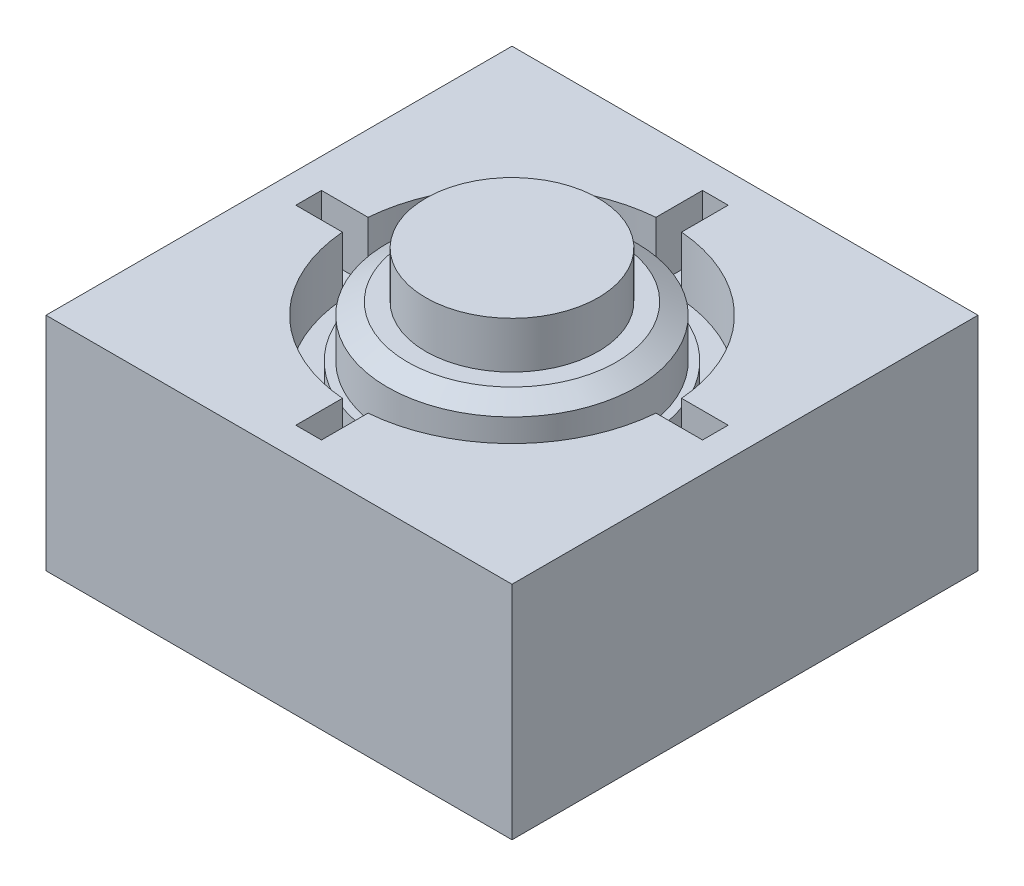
ISO-10303-21;
HEADER;
FILE_DESCRIPTION(('STEP AP214'),'2;1');
FILE_NAME('part.step','',(''),(''),'','','');
FILE_SCHEMA(('AUTOMOTIVE_DESIGN { 1 0 10303 214 1 1 1 1 }'));
ENDSEC;
DATA;
#1=APPLICATION_CONTEXT('core data for automotive mechanical design processes');
#2=APPLICATION_PROTOCOL_DEFINITION('international standard','automotive_design',2000,#1);
#3=PRODUCT_CONTEXT('',#1,'mechanical');
#4=PRODUCT('Part','Part','',(#3));
#5=PRODUCT_RELATED_PRODUCT_CATEGORY('part','',(#4));
#6=PRODUCT_DEFINITION_FORMATION('','',#4);
#7=PRODUCT_DEFINITION_CONTEXT('part definition',#1,'design');
#8=PRODUCT_DEFINITION('design','',#6,#7);
#9=PRODUCT_DEFINITION_SHAPE('','',#8);
#10=(LENGTH_UNIT() NAMED_UNIT(*) SI_UNIT(.MILLI.,.METRE.));
#11=(NAMED_UNIT(*) PLANE_ANGLE_UNIT() SI_UNIT($,.RADIAN.));
#12=(NAMED_UNIT(*) SI_UNIT($,.STERADIAN.) SOLID_ANGLE_UNIT());
#13=UNCERTAINTY_MEASURE_WITH_UNIT(LENGTH_MEASURE(1.E-05),#10,'distance_accuracy_value','');
#14=(GEOMETRIC_REPRESENTATION_CONTEXT(3) GLOBAL_UNCERTAINTY_ASSIGNED_CONTEXT((#13)) GLOBAL_UNIT_ASSIGNED_CONTEXT((#10,
#11,#12)) REPRESENTATION_CONTEXT('',''));
#15=CARTESIAN_POINT('',(0.,0.,0.));
#16=DIRECTION('',(0.,0.,1.));
#17=DIRECTION('',(1.,0.,0.));
#18=AXIS2_PLACEMENT_3D('',#15,#16,#17);
#19=CARTESIAN_POINT('',(0.,7.,0.));
#20=DIRECTION('',(0.,1.,0.));
#21=DIRECTION('',(0.,0.,1.));
#22=AXIS2_PLACEMENT_3D('',#19,#20,#21);
#23=CYLINDRICAL_SURFACE('',#22,6.75);
#24=CARTESIAN_POINT('',(0.,9.5,0.));
#25=DIRECTION('',(0.,1.,0.));
#26=DIRECTION('',(0.,0.,1.));
#27=AXIS2_PLACEMENT_3D('',#24,#25,#26);
#28=CIRCLE('',#27,6.75);
#29=CARTESIAN_POINT('',(6.72755527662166,9.5,0.550000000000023));
#30=VERTEX_POINT('',#29);
#31=CARTESIAN_POINT('',(0.550000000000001,9.5,6.72755527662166));
#32=VERTEX_POINT('',#31);
#33=EDGE_CURVE('E178',#30,#32,#28,.F.);
#34=ORIENTED_EDGE('',*,*,#33,.F.);
#35=DIRECTION('',(0.,1.,0.));
#36=VECTOR('',#35,1.);
#37=CARTESIAN_POINT('',(6.72755527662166,7.,0.550000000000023));
#38=LINE('',#37,#36);
#39=CARTESIAN_POINT('',(6.72755527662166,7.,0.550000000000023));
#40=VERTEX_POINT('',#39);
#41=EDGE_CURVE('E188',#40,#30,#38,.T.);
#42=ORIENTED_EDGE('',*,*,#41,.F.);
#43=CARTESIAN_POINT('',(0.,7.,0.));
#44=DIRECTION('',(0.,1.,0.));
#45=DIRECTION('',(0.,0.,1.));
#46=AXIS2_PLACEMENT_3D('',#43,#44,#45);
#47=CIRCLE('',#46,6.75);
#48=CARTESIAN_POINT('',(0.550000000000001,7.,6.72755527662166));
#49=VERTEX_POINT('',#48);
#50=EDGE_CURVE('E275',#49,#40,#47,.T.);
#51=ORIENTED_EDGE('',*,*,#50,.F.);
#52=DIRECTION('',(0.,1.,0.));
#53=VECTOR('',#52,1.);
#54=CARTESIAN_POINT('',(0.550000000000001,7.,6.72755527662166));
#55=LINE('',#54,#53);
#56=EDGE_CURVE('E191',#49,#32,#55,.T.);
#57=ORIENTED_EDGE('',*,*,#56,.T.);
#58=EDGE_LOOP('',(#34,#42,#51,#57));
#59=FACE_BOUND('',#58,.T.);
#60=ADVANCED_FACE('F39',(#59),#23,.F.);
#61=CARTESIAN_POINT('',(0.,9.5,0.));
#62=DIRECTION('',(0.,1.,0.));
#63=DIRECTION('',(0.,0.,1.));
#64=AXIS2_PLACEMENT_3D('',#61,#62,#63);
#65=CIRCLE('',#64,6.75);
#66=CARTESIAN_POINT('',(-6.72755527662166,9.5,-0.550000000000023));
#67=VERTEX_POINT('',#66);
#68=CARTESIAN_POINT('',(-0.550000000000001,9.5,-6.72755527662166));
#69=VERTEX_POINT('',#68);
#70=EDGE_CURVE('E386',#67,#69,#65,.F.);
#71=ORIENTED_EDGE('',*,*,#70,.F.);
#72=DIRECTION('',(0.,1.,0.));
#73=VECTOR('',#72,1.);
#74=CARTESIAN_POINT('',(-6.72755527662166,7.,-0.550000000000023));
#75=LINE('',#74,#73);
#76=CARTESIAN_POINT('',(-6.72755527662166,7.,-0.550000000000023));
#77=VERTEX_POINT('',#76);
#78=EDGE_CURVE('E218',#77,#67,#75,.T.);
#79=ORIENTED_EDGE('',*,*,#78,.F.);
#80=CARTESIAN_POINT('',(-0.549999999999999,7.,-6.72755527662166));
#81=VERTEX_POINT('',#80);
#82=EDGE_CURVE('E279',#81,#77,#47,.T.);
#83=ORIENTED_EDGE('',*,*,#82,.F.);
#84=DIRECTION('',(0.,1.,0.));
#85=VECTOR('',#84,1.);
#86=CARTESIAN_POINT('',(-0.550000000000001,7.,-6.72755527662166));
#87=LINE('',#86,#85);
#88=EDGE_CURVE('E239',#81,#69,#87,.T.);
#89=ORIENTED_EDGE('',*,*,#88,.T.);
#90=EDGE_LOOP('',(#71,#79,#83,#89));
#91=FACE_BOUND('',#90,.T.);
#92=ADVANCED_FACE('F324',(#91),#23,.F.);
#93=CARTESIAN_POINT('',(0.,9.5,0.));
#94=DIRECTION('',(0.,1.,0.));
#95=DIRECTION('',(0.,0.,1.));
#96=AXIS2_PLACEMENT_3D('',#93,#94,#95);
#97=CIRCLE('',#96,6.75);
#98=CARTESIAN_POINT('',(0.549999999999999,9.5,-6.72755527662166));
#99=VERTEX_POINT('',#98);
#100=CARTESIAN_POINT('',(6.72755527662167,9.5,-0.549999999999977));
#101=VERTEX_POINT('',#100);
#102=EDGE_CURVE('E193',#99,#101,#97,.F.);
#103=ORIENTED_EDGE('',*,*,#102,.F.);
#104=DIRECTION('',(0.,1.,0.));
#105=VECTOR('',#104,1.);
#106=CARTESIAN_POINT('',(0.549999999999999,7.,-6.72755527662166));
#107=LINE('',#106,#105);
#108=CARTESIAN_POINT('',(0.549999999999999,7.,-6.72755527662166));
#109=VERTEX_POINT('',#108);
#110=EDGE_CURVE('E247',#109,#99,#107,.T.);
#111=ORIENTED_EDGE('',*,*,#110,.F.);
#112=CARTESIAN_POINT('',(6.72755527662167,7.,-0.549999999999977));
#113=VERTEX_POINT('',#112);
#114=EDGE_CURVE('E278',#113,#109,#47,.T.);
#115=ORIENTED_EDGE('',*,*,#114,.F.);
#116=DIRECTION('',(0.,1.,0.));
#117=VECTOR('',#116,1.);
#118=CARTESIAN_POINT('',(6.72755527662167,7.,-0.549999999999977));
#119=LINE('',#118,#117);
#120=EDGE_CURVE('E199',#113,#101,#119,.T.);
#121=ORIENTED_EDGE('',*,*,#120,.T.);
#122=EDGE_LOOP('',(#103,#111,#115,#121));
#123=FACE_BOUND('',#122,.T.);
#124=ADVANCED_FACE('F330',(#123),#23,.F.);
#125=CARTESIAN_POINT('',(0.,9.5,0.));
#126=DIRECTION('',(0.,1.,0.));
#127=DIRECTION('',(0.,0.,1.));
#128=AXIS2_PLACEMENT_3D('',#125,#126,#127);
#129=CIRCLE('',#128,6.75);
#130=CARTESIAN_POINT('',(-0.549999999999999,9.5,6.72755527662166));
#131=VERTEX_POINT('',#130);
#132=CARTESIAN_POINT('',(-6.72755527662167,9.5,0.549999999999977));
#133=VERTEX_POINT('',#132);
#134=EDGE_CURVE('E347',#131,#133,#129,.F.);
#135=ORIENTED_EDGE('',*,*,#134,.F.);
#136=DIRECTION('',(0.,1.,0.));
#137=VECTOR('',#136,1.);
#138=CARTESIAN_POINT('',(-0.549999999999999,7.,6.72755527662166));
#139=LINE('',#138,#137);
#140=CARTESIAN_POINT('',(-0.549999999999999,7.,6.72755527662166));
#141=VERTEX_POINT('',#140);
#142=EDGE_CURVE('E260',#141,#131,#139,.T.);
#143=ORIENTED_EDGE('',*,*,#142,.F.);
#144=CARTESIAN_POINT('',(-6.72755527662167,7.,0.549999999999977));
#145=VERTEX_POINT('',#144);
#146=EDGE_CURVE('E272',#145,#141,#47,.T.);
#147=ORIENTED_EDGE('',*,*,#146,.F.);
#148=DIRECTION('',(0.,1.,0.));
#149=VECTOR('',#148,1.);
#150=CARTESIAN_POINT('',(-6.72755527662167,7.,0.549999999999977));
#151=LINE('',#150,#149);
#152=EDGE_CURVE('E222',#145,#133,#151,.T.);
#153=ORIENTED_EDGE('',*,*,#152,.T.);
#154=EDGE_LOOP('',(#135,#143,#147,#153));
#155=FACE_BOUND('',#154,.T.);
#156=ADVANCED_FACE('F326',(#155),#23,.F.);
#157=CARTESIAN_POINT('',(-0.549999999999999,7.,6.72755527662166));
#158=DIRECTION('',(-1.,0.,0.));
#159=DIRECTION('',(0.,0.,1.));
#160=AXIS2_PLACEMENT_3D('',#157,#158,#159);
#161=PLANE('',#160);
#162=DIRECTION('',(0.,0.,-1.));
#163=VECTOR('',#162,1.);
#164=CARTESIAN_POINT('',(-0.549999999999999,9.5,6.72755527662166));
#165=LINE('',#164,#163);
#166=CARTESIAN_POINT('',(-0.549999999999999,9.5,8.72755527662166));
#167=VERTEX_POINT('',#166);
#168=EDGE_CURVE('E352',#167,#131,#165,.T.);
#169=ORIENTED_EDGE('',*,*,#168,.F.);
#170=DIRECTION('',(0.,1.,0.));
#171=VECTOR('',#170,1.);
#172=CARTESIAN_POINT('',(-0.549999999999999,7.,8.72755527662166));
#173=LINE('',#172,#171);
#174=CARTESIAN_POINT('',(-0.549999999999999,7.,8.72755527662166));
#175=VERTEX_POINT('',#174);
#176=EDGE_CURVE('E252',#175,#167,#173,.T.);
#177=ORIENTED_EDGE('',*,*,#176,.F.);
#178=DIRECTION('',(0.,0.,1.));
#179=VECTOR('',#178,1.);
#180=CARTESIAN_POINT('',(-0.549999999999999,7.,6.72755527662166));
#181=LINE('',#180,#179);
#182=EDGE_CURVE('E233',#141,#175,#181,.T.);
#183=ORIENTED_EDGE('',*,*,#182,.F.);
#184=ORIENTED_EDGE('',*,*,#142,.T.);
#185=EDGE_LOOP('',(#169,#177,#183,#184));
#186=FACE_BOUND('',#185,.T.);
#187=ADVANCED_FACE('F335',(#186),#161,.F.);
#188=CARTESIAN_POINT('',(0.550000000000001,7.,6.72755527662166));
#189=DIRECTION('',(1.,0.,0.));
#190=DIRECTION('',(0.,0.,-1.));
#191=AXIS2_PLACEMENT_3D('',#188,#189,#190);
#192=PLANE('',#191);
#193=DIRECTION('',(0.,0.,1.));
#194=VECTOR('',#193,1.);
#195=CARTESIAN_POINT('',(0.550000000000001,9.5,6.72755527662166));
#196=LINE('',#195,#194);
#197=CARTESIAN_POINT('',(0.550000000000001,9.5,8.72755527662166));
#198=VERTEX_POINT('',#197);
#199=EDGE_CURVE('E384',#32,#198,#196,.T.);
#200=ORIENTED_EDGE('',*,*,#199,.F.);
#201=ORIENTED_EDGE('',*,*,#56,.F.);
#202=DIRECTION('',(0.,0.,-1.));
#203=VECTOR('',#202,1.);
#204=CARTESIAN_POINT('',(0.550000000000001,7.,6.72755527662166));
#205=LINE('',#204,#203);
#206=CARTESIAN_POINT('',(0.550000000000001,7.,8.72755527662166));
#207=VERTEX_POINT('',#206);
#208=EDGE_CURVE('E255',#207,#49,#205,.T.);
#209=ORIENTED_EDGE('',*,*,#208,.F.);
#210=DIRECTION('',(0.,1.,0.));
#211=VECTOR('',#210,1.);
#212=CARTESIAN_POINT('',(0.550000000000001,7.,8.72755527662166));
#213=LINE('',#212,#211);
#214=EDGE_CURVE('E256',#207,#198,#213,.T.);
#215=ORIENTED_EDGE('',*,*,#214,.T.);
#216=EDGE_LOOP('',(#200,#201,#209,#215));
#217=FACE_BOUND('',#216,.T.);
#218=ADVANCED_FACE('F341',(#217),#192,.F.);
#219=CARTESIAN_POINT('',(-0.549999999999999,7.,8.72755527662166));
#220=DIRECTION('',(0.,0.,1.));
#221=DIRECTION('',(1.,0.,0.));
#222=AXIS2_PLACEMENT_3D('',#219,#220,#221);
#223=PLANE('',#222);
#224=DIRECTION('',(-1.,0.,0.));
#225=VECTOR('',#224,1.);
#226=CARTESIAN_POINT('',(-0.549999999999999,9.5,8.72755527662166));
#227=LINE('',#226,#225);
#228=EDGE_CURVE('E390',#198,#167,#227,.T.);
#229=ORIENTED_EDGE('',*,*,#228,.F.);
#230=ORIENTED_EDGE('',*,*,#214,.F.);
#231=DIRECTION('',(1.,0.,0.));
#232=VECTOR('',#231,1.);
#233=CARTESIAN_POINT('',(-0.549999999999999,7.,8.72755527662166));
#234=LINE('',#233,#232);
#235=EDGE_CURVE('E264',#175,#207,#234,.T.);
#236=ORIENTED_EDGE('',*,*,#235,.F.);
#237=ORIENTED_EDGE('',*,*,#176,.T.);
#238=EDGE_LOOP('',(#229,#230,#236,#237));
#239=FACE_BOUND('',#238,.T.);
#240=ADVANCED_FACE('F417',(#239),#223,.F.);
#241=CARTESIAN_POINT('',(-0.550000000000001,7.,-8.72755527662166));
#242=DIRECTION('',(-1.,0.,0.));
#243=DIRECTION('',(0.,0.,1.));
#244=AXIS2_PLACEMENT_3D('',#241,#242,#243);
#245=PLANE('',#244);
#246=DIRECTION('',(0.,0.,-1.));
#247=VECTOR('',#246,1.);
#248=CARTESIAN_POINT('',(-0.550000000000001,9.5,-8.72755527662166));
#249=LINE('',#248,#247);
#250=CARTESIAN_POINT('',(-0.550000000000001,9.5,-8.72755527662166));
#251=VERTEX_POINT('',#250);
#252=EDGE_CURVE('E382',#69,#251,#249,.T.);
#253=ORIENTED_EDGE('',*,*,#252,.F.);
#254=ORIENTED_EDGE('',*,*,#88,.F.);
#255=DIRECTION('',(0.,0.,1.));
#256=VECTOR('',#255,1.);
#257=CARTESIAN_POINT('',(-0.550000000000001,7.,-8.72755527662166));
#258=LINE('',#257,#256);
#259=CARTESIAN_POINT('',(-0.550000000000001,7.,-8.72755527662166));
#260=VERTEX_POINT('',#259);
#261=EDGE_CURVE('E230',#260,#81,#258,.T.);
#262=ORIENTED_EDGE('',*,*,#261,.F.);
#263=DIRECTION('',(0.,1.,0.));
#264=VECTOR('',#263,1.);
#265=CARTESIAN_POINT('',(-0.550000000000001,7.,-8.72755527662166));
#266=LINE('',#265,#264);
#267=EDGE_CURVE('E240',#260,#251,#266,.T.);
#268=ORIENTED_EDGE('',*,*,#267,.T.);
#269=EDGE_LOOP('',(#253,#254,#262,#268));
#270=FACE_BOUND('',#269,.T.);
#271=ADVANCED_FACE('F419',(#270),#245,.F.);
#272=CARTESIAN_POINT('',(-0.550000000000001,7.,-8.72755527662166));
#273=DIRECTION('',(0.,0.,-1.));
#274=DIRECTION('',(-1.,0.,0.));
#275=AXIS2_PLACEMENT_3D('',#272,#273,#274);
#276=PLANE('',#275);
#277=DIRECTION('',(1.,0.,0.));
#278=VECTOR('',#277,1.);
#279=CARTESIAN_POINT('',(-0.550000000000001,9.5,-8.72755527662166));
#280=LINE('',#279,#278);
#281=CARTESIAN_POINT('',(0.549999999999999,9.5,-8.72755527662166));
#282=VERTEX_POINT('',#281);
#283=EDGE_CURVE('E380',#251,#282,#280,.T.);
#284=ORIENTED_EDGE('',*,*,#283,.F.);
#285=ORIENTED_EDGE('',*,*,#267,.F.);
#286=DIRECTION('',(-1.,0.,0.));
#287=VECTOR('',#286,1.);
#288=CARTESIAN_POINT('',(-0.550000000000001,7.,-8.72755527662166));
#289=LINE('',#288,#287);
#290=CARTESIAN_POINT('',(0.549999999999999,7.,-8.72755527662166));
#291=VERTEX_POINT('',#290);
#292=EDGE_CURVE('E236',#291,#260,#289,.T.);
#293=ORIENTED_EDGE('',*,*,#292,.F.);
#294=DIRECTION('',(0.,1.,0.));
#295=VECTOR('',#294,1.);
#296=CARTESIAN_POINT('',(0.549999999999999,7.,-8.72755527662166));
#297=LINE('',#296,#295);
#298=EDGE_CURVE('E244',#291,#282,#297,.T.);
#299=ORIENTED_EDGE('',*,*,#298,.T.);
#300=EDGE_LOOP('',(#284,#285,#293,#299));
#301=FACE_BOUND('',#300,.T.);
#302=ADVANCED_FACE('F425',(#301),#276,.F.);
#303=CARTESIAN_POINT('',(0.549999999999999,7.,-8.72755527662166));
#304=DIRECTION('',(1.,0.,0.));
#305=DIRECTION('',(0.,0.,-1.));
#306=AXIS2_PLACEMENT_3D('',#303,#304,#305);
#307=PLANE('',#306);
#308=DIRECTION('',(0.,0.,1.));
#309=VECTOR('',#308,1.);
#310=CARTESIAN_POINT('',(0.549999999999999,9.5,-8.72755527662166));
#311=LINE('',#310,#309);
#312=EDGE_CURVE('E192',#282,#99,#311,.T.);
#313=ORIENTED_EDGE('',*,*,#312,.F.);
#314=ORIENTED_EDGE('',*,*,#298,.F.);
#315=DIRECTION('',(0.,0.,-1.));
#316=VECTOR('',#315,1.);
#317=CARTESIAN_POINT('',(0.549999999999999,7.,-8.72755527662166));
#318=LINE('',#317,#316);
#319=EDGE_CURVE('E232',#109,#291,#318,.T.);
#320=ORIENTED_EDGE('',*,*,#319,.F.);
#321=ORIENTED_EDGE('',*,*,#110,.T.);
#322=EDGE_LOOP('',(#313,#314,#320,#321));
#323=FACE_BOUND('',#322,.T.);
#324=ADVANCED_FACE('F371',(#323),#307,.F.);
#325=CARTESIAN_POINT('',(-6.72755527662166,7.,-0.550000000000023));
#326=DIRECTION('',(0.,0.,-1.));
#327=DIRECTION('',(-1.,0.,0.));
#328=AXIS2_PLACEMENT_3D('',#325,#326,#327);
#329=PLANE('',#328);
#330=DIRECTION('',(1.,0.,0.));
#331=VECTOR('',#330,1.);
#332=CARTESIAN_POINT('',(-6.72755527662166,9.5,-0.550000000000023));
#333=LINE('',#332,#331);
#334=CARTESIAN_POINT('',(-8.72755527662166,9.5,-0.550000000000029));
#335=VERTEX_POINT('',#334);
#336=EDGE_CURVE('E388',#335,#67,#333,.T.);
#337=ORIENTED_EDGE('',*,*,#336,.F.);
#338=DIRECTION('',(0.,1.,0.));
#339=VECTOR('',#338,1.);
#340=CARTESIAN_POINT('',(-8.72755527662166,7.,-0.550000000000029));
#341=LINE('',#340,#339);
#342=CARTESIAN_POINT('',(-8.72755527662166,7.,-0.550000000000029));
#343=VERTEX_POINT('',#342);
#344=EDGE_CURVE('E217',#343,#335,#341,.T.);
#345=ORIENTED_EDGE('',*,*,#344,.F.);
#346=DIRECTION('',(-1.,0.,0.));
#347=VECTOR('',#346,1.);
#348=CARTESIAN_POINT('',(-6.72755527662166,7.,-0.550000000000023));
#349=LINE('',#348,#347);
#350=EDGE_CURVE('E208',#77,#343,#349,.T.);
#351=ORIENTED_EDGE('',*,*,#350,.F.);
#352=ORIENTED_EDGE('',*,*,#78,.T.);
#353=EDGE_LOOP('',(#337,#345,#351,#352));
#354=FACE_BOUND('',#353,.T.);
#355=ADVANCED_FACE('F453',(#354),#329,.F.);
#356=CARTESIAN_POINT('',(-6.72755527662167,7.,0.549999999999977));
#357=DIRECTION('',(0.,0.,1.));
#358=DIRECTION('',(1.,0.,0.));
#359=AXIS2_PLACEMENT_3D('',#356,#357,#358);
#360=PLANE('',#359);
#361=DIRECTION('',(-1.,0.,0.));
#362=VECTOR('',#361,1.);
#363=CARTESIAN_POINT('',(-6.72755527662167,9.5,0.549999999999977));
#364=LINE('',#363,#362);
#365=CARTESIAN_POINT('',(-8.72755527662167,9.5,0.549999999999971));
#366=VERTEX_POINT('',#365);
#367=EDGE_CURVE('E394',#133,#366,#364,.T.);
#368=ORIENTED_EDGE('',*,*,#367,.F.);
#369=ORIENTED_EDGE('',*,*,#152,.F.);
#370=DIRECTION('',(1.,0.,0.));
#371=VECTOR('',#370,1.);
#372=CARTESIAN_POINT('',(-6.72755527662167,7.,0.549999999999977));
#373=LINE('',#372,#371);
#374=CARTESIAN_POINT('',(-8.72755527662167,7.,0.549999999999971));
#375=VERTEX_POINT('',#374);
#376=EDGE_CURVE('E215',#375,#145,#373,.T.);
#377=ORIENTED_EDGE('',*,*,#376,.F.);
#378=DIRECTION('',(0.,1.,0.));
#379=VECTOR('',#378,1.);
#380=CARTESIAN_POINT('',(-8.72755527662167,7.,0.549999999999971));
#381=LINE('',#380,#379);
#382=EDGE_CURVE('E225',#375,#366,#381,.T.);
#383=ORIENTED_EDGE('',*,*,#382,.T.);
#384=EDGE_LOOP('',(#368,#369,#377,#383));
#385=FACE_BOUND('',#384,.T.);
#386=ADVANCED_FACE('F450',(#385),#360,.F.);
#387=CARTESIAN_POINT('',(-8.72755527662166,7.,-0.550000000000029));
#388=DIRECTION('',(-1.,0.,0.));
#389=DIRECTION('',(0.,0.,1.));
#390=AXIS2_PLACEMENT_3D('',#387,#388,#389);
#391=PLANE('',#390);
#392=DIRECTION('',(0.,0.,-1.));
#393=VECTOR('',#392,1.);
#394=CARTESIAN_POINT('',(-8.72755527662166,9.5,-0.550000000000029));
#395=LINE('',#394,#393);
#396=EDGE_CURVE('E351',#366,#335,#395,.T.);
#397=ORIENTED_EDGE('',*,*,#396,.F.);
#398=ORIENTED_EDGE('',*,*,#382,.F.);
#399=DIRECTION('',(0.,0.,1.));
#400=VECTOR('',#399,1.);
#401=CARTESIAN_POINT('',(-8.72755527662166,7.,-0.550000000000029));
#402=LINE('',#401,#400);
#403=EDGE_CURVE('E211',#343,#375,#402,.T.);
#404=ORIENTED_EDGE('',*,*,#403,.F.);
#405=ORIENTED_EDGE('',*,*,#344,.T.);
#406=EDGE_LOOP('',(#397,#398,#404,#405));
#407=FACE_BOUND('',#406,.T.);
#408=ADVANCED_FACE('F449',(#407),#391,.F.);
#409=CARTESIAN_POINT('',(8.72755527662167,7.,-0.549999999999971));
#410=DIRECTION('',(0.,0.,-1.));
#411=DIRECTION('',(-1.,0.,0.));
#412=AXIS2_PLACEMENT_3D('',#409,#410,#411);
#413=PLANE('',#412);
#414=DIRECTION('',(1.,0.,0.));
#415=VECTOR('',#414,1.);
#416=CARTESIAN_POINT('',(8.72755527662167,9.5,-0.549999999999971));
#417=LINE('',#416,#415);
#418=CARTESIAN_POINT('',(8.72755527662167,9.5,-0.549999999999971));
#419=VERTEX_POINT('',#418);
#420=EDGE_CURVE('E374',#101,#419,#417,.T.);
#421=ORIENTED_EDGE('',*,*,#420,.F.);
#422=ORIENTED_EDGE('',*,*,#120,.F.);
#423=DIRECTION('',(-1.,0.,0.));
#424=VECTOR('',#423,1.);
#425=CARTESIAN_POINT('',(8.72755527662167,7.,-0.549999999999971));
#426=LINE('',#425,#424);
#427=CARTESIAN_POINT('',(8.72755527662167,7.,-0.549999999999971));
#428=VERTEX_POINT('',#427);
#429=EDGE_CURVE('E221',#428,#113,#426,.T.);
#430=ORIENTED_EDGE('',*,*,#429,.F.);
#431=DIRECTION('',(0.,1.,0.));
#432=VECTOR('',#431,1.);
#433=CARTESIAN_POINT('',(8.72755527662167,7.,-0.549999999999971));
#434=LINE('',#433,#432);
#435=EDGE_CURVE('E201',#428,#419,#434,.T.);
#436=ORIENTED_EDGE('',*,*,#435,.T.);
#437=EDGE_LOOP('',(#421,#422,#430,#436));
#438=FACE_BOUND('',#437,.T.);
#439=ADVANCED_FACE('F409',(#438),#413,.F.);
#440=CARTESIAN_POINT('',(8.72755527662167,7.,-0.549999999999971));
#441=DIRECTION('',(1.,0.,0.));
#442=DIRECTION('',(0.,0.,-1.));
#443=AXIS2_PLACEMENT_3D('',#440,#441,#442);
#444=PLANE('',#443);
#445=DIRECTION('',(0.,0.,1.));
#446=VECTOR('',#445,1.);
#447=CARTESIAN_POINT('',(8.72755527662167,9.5,-0.549999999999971));
#448=LINE('',#447,#446);
#449=CARTESIAN_POINT('',(8.72755527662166,9.5,0.55000000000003));
#450=VERTEX_POINT('',#449);
#451=EDGE_CURVE('E64',#419,#450,#448,.T.);
#452=ORIENTED_EDGE('',*,*,#451,.F.);
#453=ORIENTED_EDGE('',*,*,#435,.F.);
#454=DIRECTION('',(0.,0.,-1.));
#455=VECTOR('',#454,1.);
#456=CARTESIAN_POINT('',(8.72755527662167,7.,-0.549999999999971));
#457=LINE('',#456,#455);
#458=CARTESIAN_POINT('',(8.72755527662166,7.,0.55000000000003));
#459=VERTEX_POINT('',#458);
#460=EDGE_CURVE('E204',#459,#428,#457,.T.);
#461=ORIENTED_EDGE('',*,*,#460,.F.);
#462=DIRECTION('',(0.,1.,0.));
#463=VECTOR('',#462,1.);
#464=CARTESIAN_POINT('',(8.72755527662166,7.,0.55000000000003));
#465=LINE('',#464,#463);
#466=EDGE_CURVE('E198',#459,#450,#465,.T.);
#467=ORIENTED_EDGE('',*,*,#466,.T.);
#468=EDGE_LOOP('',(#452,#453,#461,#467));
#469=FACE_BOUND('',#468,.T.);
#470=ADVANCED_FACE('F412',(#469),#444,.F.);
#471=CARTESIAN_POINT('',(8.72755527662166,7.,0.55000000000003));
#472=DIRECTION('',(0.,0.,1.));
#473=DIRECTION('',(1.,0.,0.));
#474=AXIS2_PLACEMENT_3D('',#471,#472,#473);
#475=PLANE('',#474);
#476=DIRECTION('',(-1.,0.,0.));
#477=VECTOR('',#476,1.);
#478=CARTESIAN_POINT('',(8.72755527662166,9.5,0.55000000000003));
#479=LINE('',#478,#477);
#480=EDGE_CURVE('E175',#450,#30,#479,.T.);
#481=ORIENTED_EDGE('',*,*,#480,.F.);
#482=ORIENTED_EDGE('',*,*,#466,.F.);
#483=DIRECTION('',(1.,0.,0.));
#484=VECTOR('',#483,1.);
#485=CARTESIAN_POINT('',(8.72755527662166,7.,0.55000000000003));
#486=LINE('',#485,#484);
#487=EDGE_CURVE('E197',#40,#459,#486,.T.);
#488=ORIENTED_EDGE('',*,*,#487,.F.);
#489=ORIENTED_EDGE('',*,*,#41,.T.);
#490=EDGE_LOOP('',(#481,#482,#488,#489));
#491=FACE_BOUND('',#490,.T.);
#492=ADVANCED_FACE('F195',(#491),#475,.F.);
#493=CARTESIAN_POINT('',(0.,7.,0.));
#494=DIRECTION('',(0.,1.,0.));
#495=DIRECTION('',(0.,0.,1.));
#496=AXIS2_PLACEMENT_3D('',#493,#494,#495);
#497=PLANE('',#496);
#498=ORIENTED_EDGE('',*,*,#50,.T.);
#499=ORIENTED_EDGE('',*,*,#487,.T.);
#500=ORIENTED_EDGE('',*,*,#460,.T.);
#501=ORIENTED_EDGE('',*,*,#429,.T.);
#502=ORIENTED_EDGE('',*,*,#114,.T.);
#503=ORIENTED_EDGE('',*,*,#319,.T.);
#504=ORIENTED_EDGE('',*,*,#292,.T.);
#505=ORIENTED_EDGE('',*,*,#261,.T.);
#506=ORIENTED_EDGE('',*,*,#82,.T.);
#507=ORIENTED_EDGE('',*,*,#350,.T.);
#508=ORIENTED_EDGE('',*,*,#403,.T.);
#509=ORIENTED_EDGE('',*,*,#376,.T.);
#510=ORIENTED_EDGE('',*,*,#146,.T.);
#511=ORIENTED_EDGE('',*,*,#182,.T.);
#512=ORIENTED_EDGE('',*,*,#235,.T.);
#513=ORIENTED_EDGE('',*,*,#208,.T.);
#514=EDGE_LOOP('',(#498,#499,#500,#501,#502,#503,#504,#505,#506,#507,#508,#509,#510,#511,#512,#513));
#515=FACE_BOUND('',#514,.T.);
#516=CARTESIAN_POINT('',(0.,7.,0.));
#517=DIRECTION('',(0.,1.,0.));
#518=DIRECTION('',(0.,0.,1.));
#519=AXIS2_PLACEMENT_3D('',#516,#517,#518);
#520=CIRCLE('',#519,5.7);
#521=CARTESIAN_POINT('',(0.,7.,5.7));
#522=VERTEX_POINT('',#521);
#523=EDGE_CURVE('E243',#522,#522,#520,.T.);
#524=ORIENTED_EDGE('',*,*,#523,.F.);
#525=EDGE_LOOP('',(#524));
#526=FACE_BOUND('',#525,.T.);
#527=ADVANCED_FACE('F358',(#515,#526),#497,.T.);
#528=CARTESIAN_POINT('',(0.,7.8,0.));
#529=DIRECTION('',(0.,-1.,0.));
#530=DIRECTION('',(0.,0.,-1.));
#531=AXIS2_PLACEMENT_3D('',#528,#529,#530);
#532=CYLINDRICAL_SURFACE('',#531,5.7);
#533=CARTESIAN_POINT('',(0.,7.8,0.));
#534=DIRECTION('',(0.,1.,0.));
#535=DIRECTION('',(0.,0.,1.));
#536=AXIS2_PLACEMENT_3D('',#533,#534,#535);
#537=CIRCLE('',#536,5.7);
#538=CARTESIAN_POINT('',(0.,7.8,5.7));
#539=VERTEX_POINT('',#538);
#540=EDGE_CURVE('E269',#539,#539,#537,.T.);
#541=ORIENTED_EDGE('',*,*,#540,.F.);
#542=EDGE_LOOP('',(#541));
#543=FACE_BOUND('',#542,.T.);
#544=ORIENTED_EDGE('',*,*,#523,.T.);
#545=EDGE_LOOP('',(#544));
#546=FACE_BOUND('',#545,.T.);
#547=ADVANCED_FACE('F433',(#543,#546),#532,.T.);
#548=CARTESIAN_POINT('',(0.,7.8,0.));
#549=DIRECTION('',(0.,1.,0.));
#550=DIRECTION('',(0.,0.,1.));
#551=AXIS2_PLACEMENT_3D('',#548,#549,#550);
#552=PLANE('',#551);
#553=CARTESIAN_POINT('',(0.,7.8,0.));
#554=DIRECTION('',(0.,1.,0.));
#555=DIRECTION('',(0.,0.,1.));
#556=AXIS2_PLACEMENT_3D('',#553,#554,#555);
#557=CIRCLE('',#556,5.35);
#558=CARTESIAN_POINT('',(0.,7.8,5.35));
#559=VERTEX_POINT('',#558);
#560=EDGE_CURVE('E299',#559,#559,#557,.F.);
#561=ORIENTED_EDGE('',*,*,#560,.T.);
#562=EDGE_LOOP('',(#561));
#563=FACE_BOUND('',#562,.T.);
#564=ORIENTED_EDGE('',*,*,#540,.T.);
#565=EDGE_LOOP('',(#564));
#566=FACE_BOUND('',#565,.T.);
#567=ADVANCED_FACE('F430',(#563,#566),#552,.T.);
#568=CARTESIAN_POINT('',(0.,10.,0.));
#569=DIRECTION('',(0.,1.,0.));
#570=DIRECTION('',(0.,0.,1.));
#571=AXIS2_PLACEMENT_3D('',#568,#569,#570);
#572=PLANE('',#571);
#573=CARTESIAN_POINT('',(0.,10.,0.));
#574=DIRECTION('',(0.,1.,0.));
#575=DIRECTION('',(0.,0.,1.));
#576=AXIS2_PLACEMENT_3D('',#573,#574,#575);
#577=CIRCLE('',#576,3.7);
#578=CARTESIAN_POINT('',(0.,10.,3.7));
#579=VERTEX_POINT('',#578);
#580=EDGE_CURVE('E11',#579,#579,#577,.T.);
#581=ORIENTED_EDGE('',*,*,#580,.F.);
#582=EDGE_LOOP('',(#581));
#583=FACE_BOUND('',#582,.T.);
#584=CARTESIAN_POINT('',(0.,10.,0.));
#585=DIRECTION('',(0.,1.,0.));
#586=DIRECTION('',(0.,0.,1.));
#587=AXIS2_PLACEMENT_3D('',#584,#585,#586);
#588=CIRCLE('',#587,4.48397459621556);
#589=CARTESIAN_POINT('',(0.,10.,4.48397459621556));
#590=VERTEX_POINT('',#589);
#591=EDGE_CURVE('E301',#590,#590,#588,.T.);
#592=ORIENTED_EDGE('',*,*,#591,.T.);
#593=EDGE_LOOP('',(#592));
#594=FACE_BOUND('',#593,.T.);
#595=ADVANCED_FACE('F321',(#583,#594),#572,.T.);
#596=CARTESIAN_POINT('',(0.,7.,0.));
#597=DIRECTION('',(0.,1.,0.));
#598=DIRECTION('',(0.,0.,1.));
#599=AXIS2_PLACEMENT_3D('',#596,#597,#598);
#600=CYLINDRICAL_SURFACE('',#599,5.35);
#601=CARTESIAN_POINT('',(0.,9.5,0.));
#602=DIRECTION('',(0.,1.,0.));
#603=DIRECTION('',(0.,0.,1.));
#604=AXIS2_PLACEMENT_3D('',#601,#602,#603);
#605=CIRCLE('',#604,5.35);
#606=CARTESIAN_POINT('',(0.,9.5,5.35));
#607=VERTEX_POINT('',#606);
#608=EDGE_CURVE('E44',#607,#607,#605,.F.);
#609=ORIENTED_EDGE('',*,*,#608,.T.);
#610=EDGE_LOOP('',(#609));
#611=FACE_BOUND('',#610,.T.);
#612=ORIENTED_EDGE('',*,*,#560,.F.);
#613=EDGE_LOOP('',(#612));
#614=FACE_BOUND('',#613,.T.);
#615=ADVANCED_FACE('F308',(#611,#614),#600,.T.);
#616=CARTESIAN_POINT('',(0.,10.,0.));
#617=DIRECTION('',(0.,-1.,0.));
#618=DIRECTION('',(0.,0.,-1.));
#619=AXIS2_PLACEMENT_3D('',#616,#617,#618);
#620=CONICAL_SURFACE('',#619,4.48397459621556,1.04719755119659);
#621=ORIENTED_EDGE('',*,*,#608,.F.);
#622=EDGE_LOOP('',(#621));
#623=FACE_BOUND('',#622,.T.);
#624=ORIENTED_EDGE('',*,*,#591,.F.);
#625=EDGE_LOOP('',(#624));
#626=FACE_BOUND('',#625,.T.);
#627=ADVANCED_FACE('F42',(#623,#626),#620,.T.);
#628=CARTESIAN_POINT('',(0.,12.,0.));
#629=DIRECTION('',(0.,-1.,0.));
#630=DIRECTION('',(0.,0.,-1.));
#631=AXIS2_PLACEMENT_3D('',#628,#629,#630);
#632=CYLINDRICAL_SURFACE('',#631,3.7);
#633=CARTESIAN_POINT('',(0.,12.,0.));
#634=DIRECTION('',(0.,1.,0.));
#635=DIRECTION('',(0.,0.,1.));
#636=AXIS2_PLACEMENT_3D('',#633,#634,#635);
#637=CIRCLE('',#636,3.7);
#638=CARTESIAN_POINT('',(0.,12.,3.7));
#639=VERTEX_POINT('',#638);
#640=EDGE_CURVE('E212',#639,#639,#637,.T.);
#641=ORIENTED_EDGE('',*,*,#640,.F.);
#642=EDGE_LOOP('',(#641));
#643=FACE_BOUND('',#642,.T.);
#644=ORIENTED_EDGE('',*,*,#580,.T.);
#645=EDGE_LOOP('',(#644));
#646=FACE_BOUND('',#645,.T.);
#647=ADVANCED_FACE('F313',(#643,#646),#632,.T.);
#648=CARTESIAN_POINT('',(0.,12.,0.));
#649=DIRECTION('',(0.,1.,0.));
#650=DIRECTION('',(0.,0.,1.));
#651=AXIS2_PLACEMENT_3D('',#648,#649,#650);
#652=PLANE('',#651);
#653=ORIENTED_EDGE('',*,*,#640,.T.);
#654=EDGE_LOOP('',(#653));
#655=FACE_BOUND('',#654,.T.);
#656=ADVANCED_FACE('F318',(#655),#652,.T.);
#657=CARTESIAN_POINT('',(0.,9.5,0.));
#658=DIRECTION('',(0.,1.,0.));
#659=DIRECTION('',(0.,0.,1.));
#660=AXIS2_PLACEMENT_3D('',#657,#658,#659);
#661=PLANE('',#660);
#662=ORIENTED_EDGE('',*,*,#367,.T.);
#663=ORIENTED_EDGE('',*,*,#396,.T.);
#664=ORIENTED_EDGE('',*,*,#336,.T.);
#665=ORIENTED_EDGE('',*,*,#70,.T.);
#666=ORIENTED_EDGE('',*,*,#252,.T.);
#667=ORIENTED_EDGE('',*,*,#283,.T.);
#668=ORIENTED_EDGE('',*,*,#312,.T.);
#669=ORIENTED_EDGE('',*,*,#102,.T.);
#670=ORIENTED_EDGE('',*,*,#420,.T.);
#671=ORIENTED_EDGE('',*,*,#451,.T.);
#672=ORIENTED_EDGE('',*,*,#480,.T.);
#673=ORIENTED_EDGE('',*,*,#33,.T.);
#674=ORIENTED_EDGE('',*,*,#199,.T.);
#675=ORIENTED_EDGE('',*,*,#228,.T.);
#676=ORIENTED_EDGE('',*,*,#168,.T.);
#677=ORIENTED_EDGE('',*,*,#134,.T.);
#678=EDGE_LOOP('',(#662,#663,#664,#665,#666,#667,#668,#669,#670,#671,#672,#673,#674,#675,#676,#677));
#679=FACE_BOUND('',#678,.T.);
#680=DIRECTION('',(0.,0.,1.));
#681=VECTOR('',#680,1.);
#682=CARTESIAN_POINT('',(-10.,9.5,-10.));
#683=LINE('',#682,#681);
#684=CARTESIAN_POINT('',(-10.,9.5,-10.));
#685=VERTEX_POINT('',#684);
#686=CARTESIAN_POINT('',(-10.,9.5,10.));
#687=VERTEX_POINT('',#686);
#688=EDGE_CURVE('E401',#685,#687,#683,.T.);
#689=ORIENTED_EDGE('',*,*,#688,.T.);
#690=DIRECTION('',(1.,0.,0.));
#691=VECTOR('',#690,1.);
#692=CARTESIAN_POINT('',(-10.,9.5,10.));
#693=LINE('',#692,#691);
#694=CARTESIAN_POINT('',(10.,9.5,10.));
#695=VERTEX_POINT('',#694);
#696=EDGE_CURVE('E399',#687,#695,#693,.T.);
#697=ORIENTED_EDGE('',*,*,#696,.T.);
#698=DIRECTION('',(0.,0.,-1.));
#699=VECTOR('',#698,1.);
#700=CARTESIAN_POINT('',(10.,9.5,-10.));
#701=LINE('',#700,#699);
#702=CARTESIAN_POINT('',(10.,9.5,-10.));
#703=VERTEX_POINT('',#702);
#704=EDGE_CURVE('E56',#695,#703,#701,.T.);
#705=ORIENTED_EDGE('',*,*,#704,.T.);
#706=DIRECTION('',(-1.,0.,0.));
#707=VECTOR('',#706,1.);
#708=CARTESIAN_POINT('',(-10.,9.5,-10.));
#709=LINE('',#708,#707);
#710=EDGE_CURVE('E396',#703,#685,#709,.T.);
#711=ORIENTED_EDGE('',*,*,#710,.T.);
#712=EDGE_LOOP('',(#689,#697,#705,#711));
#713=FACE_BOUND('',#712,.T.);
#714=ADVANCED_FACE('F177',(#679,#713),#661,.T.);
#715=CARTESIAN_POINT('',(0.,0.,0.));
#716=DIRECTION('',(0.,1.,0.));
#717=DIRECTION('',(0.,0.,1.));
#718=AXIS2_PLACEMENT_3D('',#715,#716,#717);
#719=PLANE('',#718);
#720=DIRECTION('',(0.,0.,1.));
#721=VECTOR('',#720,1.);
#722=CARTESIAN_POINT('',(-10.,0.,-10.));
#723=LINE('',#722,#721);
#724=CARTESIAN_POINT('',(-10.,0.,-10.));
#725=VERTEX_POINT('',#724);
#726=CARTESIAN_POINT('',(-10.,0.,10.));
#727=VERTEX_POINT('',#726);
#728=EDGE_CURVE('E277',#725,#727,#723,.T.);
#729=ORIENTED_EDGE('',*,*,#728,.F.);
#730=DIRECTION('',(-1.,0.,0.));
#731=VECTOR('',#730,1.);
#732=CARTESIAN_POINT('',(-10.,0.,-10.));
#733=LINE('',#732,#731);
#734=CARTESIAN_POINT('',(10.,0.,-10.));
#735=VERTEX_POINT('',#734);
#736=EDGE_CURVE('E288',#735,#725,#733,.T.);
#737=ORIENTED_EDGE('',*,*,#736,.F.);
#738=DIRECTION('',(0.,0.,-1.));
#739=VECTOR('',#738,1.);
#740=CARTESIAN_POINT('',(10.,0.,-10.));
#741=LINE('',#740,#739);
#742=CARTESIAN_POINT('',(10.,0.,10.));
#743=VERTEX_POINT('',#742);
#744=EDGE_CURVE('E285',#743,#735,#741,.T.);
#745=ORIENTED_EDGE('',*,*,#744,.F.);
#746=DIRECTION('',(1.,0.,0.));
#747=VECTOR('',#746,1.);
#748=CARTESIAN_POINT('',(-10.,0.,10.));
#749=LINE('',#748,#747);
#750=EDGE_CURVE('E282',#727,#743,#749,.T.);
#751=ORIENTED_EDGE('',*,*,#750,.F.);
#752=EDGE_LOOP('',(#729,#737,#745,#751));
#753=FACE_BOUND('',#752,.T.);
#754=ADVANCED_FACE('F503',(#753),#719,.F.);
#755=CARTESIAN_POINT('',(-10.,10.,-10.));
#756=DIRECTION('',(0.,0.,1.));
#757=DIRECTION('',(1.,0.,0.));
#758=AXIS2_PLACEMENT_3D('',#755,#756,#757);
#759=PLANE('',#758);
#760=ORIENTED_EDGE('',*,*,#710,.F.);
#761=DIRECTION('',(0.,-1.,0.));
#762=VECTOR('',#761,1.);
#763=CARTESIAN_POINT('',(10.,10.,-10.));
#764=LINE('',#763,#762);
#765=EDGE_CURVE('E293',#703,#735,#764,.T.);
#766=ORIENTED_EDGE('',*,*,#765,.T.);
#767=ORIENTED_EDGE('',*,*,#736,.T.);
#768=DIRECTION('',(0.,-1.,0.));
#769=VECTOR('',#768,1.);
#770=CARTESIAN_POINT('',(-10.,10.,-10.));
#771=LINE('',#770,#769);
#772=EDGE_CURVE('E291',#685,#725,#771,.T.);
#773=ORIENTED_EDGE('',*,*,#772,.F.);
#774=EDGE_LOOP('',(#760,#766,#767,#773));
#775=FACE_BOUND('',#774,.T.);
#776=ADVANCED_FACE('F512',(#775),#759,.F.);
#777=CARTESIAN_POINT('',(10.,10.,-10.));
#778=DIRECTION('',(-1.,0.,0.));
#779=DIRECTION('',(0.,0.,1.));
#780=AXIS2_PLACEMENT_3D('',#777,#778,#779);
#781=PLANE('',#780);
#782=ORIENTED_EDGE('',*,*,#704,.F.);
#783=DIRECTION('',(0.,-1.,0.));
#784=VECTOR('',#783,1.);
#785=CARTESIAN_POINT('',(10.,10.,10.));
#786=LINE('',#785,#784);
#787=EDGE_CURVE('E295',#695,#743,#786,.T.);
#788=ORIENTED_EDGE('',*,*,#787,.T.);
#789=ORIENTED_EDGE('',*,*,#744,.T.);
#790=ORIENTED_EDGE('',*,*,#765,.F.);
#791=EDGE_LOOP('',(#782,#788,#789,#790));
#792=FACE_BOUND('',#791,.T.);
#793=ADVANCED_FACE('F517',(#792),#781,.F.);
#794=CARTESIAN_POINT('',(-10.,10.,10.));
#795=DIRECTION('',(0.,0.,-1.));
#796=DIRECTION('',(-1.,0.,0.));
#797=AXIS2_PLACEMENT_3D('',#794,#795,#796);
#798=PLANE('',#797);
#799=ORIENTED_EDGE('',*,*,#696,.F.);
#800=DIRECTION('',(0.,-1.,0.));
#801=VECTOR('',#800,1.);
#802=CARTESIAN_POINT('',(-10.,10.,10.));
#803=LINE('',#802,#801);
#804=EDGE_CURVE('E297',#687,#727,#803,.T.);
#805=ORIENTED_EDGE('',*,*,#804,.T.);
#806=ORIENTED_EDGE('',*,*,#750,.T.);
#807=ORIENTED_EDGE('',*,*,#787,.F.);
#808=EDGE_LOOP('',(#799,#805,#806,#807));
#809=FACE_BOUND('',#808,.T.);
#810=ADVANCED_FACE('F528',(#809),#798,.F.);
#811=CARTESIAN_POINT('',(-10.,10.,-10.));
#812=DIRECTION('',(1.,0.,0.));
#813=DIRECTION('',(0.,0.,-1.));
#814=AXIS2_PLACEMENT_3D('',#811,#812,#813);
#815=PLANE('',#814);
#816=ORIENTED_EDGE('',*,*,#688,.F.);
#817=ORIENTED_EDGE('',*,*,#772,.T.);
#818=ORIENTED_EDGE('',*,*,#728,.T.);
#819=ORIENTED_EDGE('',*,*,#804,.F.);
#820=EDGE_LOOP('',(#816,#817,#818,#819));
#821=FACE_BOUND('',#820,.T.);
#822=ADVANCED_FACE('F538',(#821),#815,.F.);
#823=CLOSED_SHELL('',(#60,#92,#124,#156,#187,#218,#240,#271,#302,#324,#355,#386,#408,#439,#470,
#492,#527,#547,#567,#595,#615,#627,#647,#656,#714,#754,#776,#793,#810,#822));
#824=MANIFOLD_SOLID_BREP('B2',#823);
#825=ADVANCED_BREP_SHAPE_REPRESENTATION('',(#18,#824),#14);
#826=SHAPE_DEFINITION_REPRESENTATION(#9,#825);
ENDSEC;
END-ISO-10303-21;
